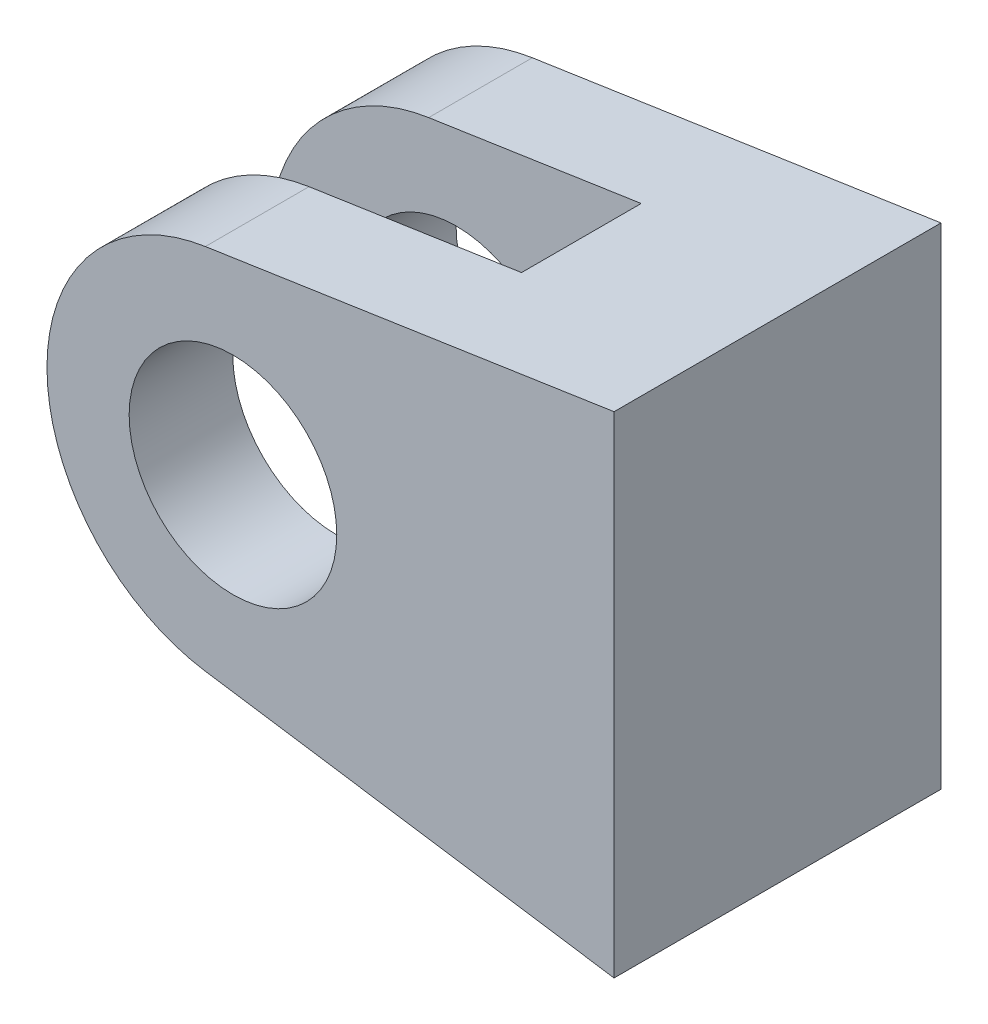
ISO-10303-21;
HEADER;
FILE_DESCRIPTION(('STEP AP214'),'2;1');
FILE_NAME('part.step','',(''),(''),'','','');
FILE_SCHEMA(('AUTOMOTIVE_DESIGN { 1 0 10303 214 1 1 1 1 }'));
ENDSEC;
DATA;
#1=APPLICATION_CONTEXT('core data for automotive mechanical design processes');
#2=APPLICATION_PROTOCOL_DEFINITION('international standard','automotive_design',2000,#1);
#3=PRODUCT_CONTEXT('',#1,'mechanical');
#4=PRODUCT('Part','Part','',(#3));
#5=PRODUCT_RELATED_PRODUCT_CATEGORY('part','',(#4));
#6=PRODUCT_DEFINITION_FORMATION('','',#4);
#7=PRODUCT_DEFINITION_CONTEXT('part definition',#1,'design');
#8=PRODUCT_DEFINITION('design','',#6,#7);
#9=PRODUCT_DEFINITION_SHAPE('','',#8);
#10=(LENGTH_UNIT() NAMED_UNIT(*) SI_UNIT(.MILLI.,.METRE.));
#11=(NAMED_UNIT(*) PLANE_ANGLE_UNIT() SI_UNIT($,.RADIAN.));
#12=(NAMED_UNIT(*) SI_UNIT($,.STERADIAN.) SOLID_ANGLE_UNIT());
#13=UNCERTAINTY_MEASURE_WITH_UNIT(LENGTH_MEASURE(1.E-05),#10,'distance_accuracy_value','');
#14=(GEOMETRIC_REPRESENTATION_CONTEXT(3) GLOBAL_UNCERTAINTY_ASSIGNED_CONTEXT((#13)) GLOBAL_UNIT_ASSIGNED_CONTEXT((#10,
#11,#12)) REPRESENTATION_CONTEXT('',''));
#15=CARTESIAN_POINT('',(0.,0.,0.));
#16=DIRECTION('',(0.,0.,1.));
#17=DIRECTION('',(1.,0.,0.));
#18=AXIS2_PLACEMENT_3D('',#15,#16,#17);
#19=CARTESIAN_POINT('',(70.917585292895,-7.78385160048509,20.));
#20=DIRECTION('',(0.,0.,-1.));
#21=DIRECTION('',(-1.,0.,0.));
#22=AXIS2_PLACEMENT_3D('',#19,#20,#21);
#23=CYLINDRICAL_SURFACE('',#22,11.3758584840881);
#24=DIRECTION('',(0.,0.,-1.));
#25=VECTOR('',#24,1.);
#26=CARTESIAN_POINT('',(69.230085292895,3.46614839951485,20.));
#27=LINE('',#26,#25);
#28=CARTESIAN_POINT('',(69.230085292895,3.46614839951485,20.));
#29=VERTEX_POINT('',#28);
#30=CARTESIAN_POINT('',(69.230085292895,3.46614839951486,13.66));
#31=VERTEX_POINT('',#30);
#32=EDGE_CURVE('E40',#29,#31,#27,.T.);
#33=ORIENTED_EDGE('',*,*,#32,.T.);
#34=CARTESIAN_POINT('',(70.917585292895,-7.78385160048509,13.66));
#35=DIRECTION('',(0.,0.,1.));
#36=DIRECTION('',(1.,0.,0.));
#37=AXIS2_PLACEMENT_3D('',#34,#35,#36);
#38=CIRCLE('',#37,11.3758584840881);
#39=CARTESIAN_POINT('',(69.230085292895,-19.033851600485,13.66));
#40=VERTEX_POINT('',#39);
#41=EDGE_CURVE('E130',#31,#40,#38,.T.);
#42=ORIENTED_EDGE('',*,*,#41,.T.);
#43=DIRECTION('',(0.,0.,-1.));
#44=VECTOR('',#43,1.);
#45=CARTESIAN_POINT('',(69.230085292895,-19.033851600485,20.));
#46=LINE('',#45,#44);
#47=CARTESIAN_POINT('',(69.230085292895,-19.033851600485,20.));
#48=VERTEX_POINT('',#47);
#49=EDGE_CURVE('E127',#48,#40,#46,.T.);
#50=ORIENTED_EDGE('',*,*,#49,.F.);
#51=CARTESIAN_POINT('',(70.917585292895,-7.78385160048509,20.));
#52=DIRECTION('',(0.,0.,1.));
#53=DIRECTION('',(1.,0.,0.));
#54=AXIS2_PLACEMENT_3D('',#51,#52,#53);
#55=CIRCLE('',#54,11.3758584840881);
#56=EDGE_CURVE('E85',#29,#48,#55,.T.);
#57=ORIENTED_EDGE('',*,*,#56,.F.);
#58=EDGE_LOOP('',(#33,#42,#50,#57));
#59=FACE_BOUND('',#58,.T.);
#60=ADVANCED_FACE('F32',(#59),#23,.T.);
#61=CARTESIAN_POINT('',(70.917585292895,-7.78385160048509,20.));
#62=DIRECTION('',(0.,0.,-1.));
#63=DIRECTION('',(-1.,0.,0.));
#64=AXIS2_PLACEMENT_3D('',#61,#62,#63);
#65=CYLINDRICAL_SURFACE('',#64,6.35);
#66=CARTESIAN_POINT('',(70.917585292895,-7.78385160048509,13.66));
#67=DIRECTION('',(0.,0.,1.));
#68=DIRECTION('',(1.,0.,0.));
#69=AXIS2_PLACEMENT_3D('',#66,#67,#68);
#70=CIRCLE('',#69,6.35);
#71=CARTESIAN_POINT('',(77.267585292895,-7.78385160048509,13.66));
#72=VERTEX_POINT('',#71);
#73=EDGE_CURVE('E131',#72,#72,#70,.T.);
#74=ORIENTED_EDGE('',*,*,#73,.F.);
#75=EDGE_LOOP('',(#74));
#76=FACE_BOUND('',#75,.T.);
#77=CARTESIAN_POINT('',(70.917585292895,-7.78385160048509,20.));
#78=DIRECTION('',(0.,0.,1.));
#79=DIRECTION('',(1.,0.,0.));
#80=AXIS2_PLACEMENT_3D('',#77,#78,#79);
#81=CIRCLE('',#80,6.35);
#82=CARTESIAN_POINT('',(77.267585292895,-7.78385160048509,20.));
#83=VERTEX_POINT('',#82);
#84=EDGE_CURVE('E144',#83,#83,#81,.T.);
#85=ORIENTED_EDGE('',*,*,#84,.T.);
#86=EDGE_LOOP('',(#85));
#87=FACE_BOUND('',#86,.T.);
#88=ADVANCED_FACE('F204',(#76,#87),#65,.F.);
#89=CARTESIAN_POINT('',(70.917585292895,-7.78385160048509,20.));
#90=DIRECTION('',(0.,0.,1.));
#91=DIRECTION('',(1.,0.,0.));
#92=AXIS2_PLACEMENT_3D('',#89,#90,#91);
#93=PLANE('',#92);
#94=DIRECTION('',(-0.988936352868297,-0.148340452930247,0.));
#95=VECTOR('',#94,1.);
#96=CARTESIAN_POINT('',(94.230085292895,7.21614839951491,20.));
#97=LINE('',#96,#95);
#98=CARTESIAN_POINT('',(94.230085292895,7.21614839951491,20.));
#99=VERTEX_POINT('',#98);
#100=EDGE_CURVE('E150',#99,#29,#97,.T.);
#101=ORIENTED_EDGE('',*,*,#100,.T.);
#102=ORIENTED_EDGE('',*,*,#56,.T.);
#103=DIRECTION('',(0.988936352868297,-0.148340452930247,0.));
#104=VECTOR('',#103,1.);
#105=CARTESIAN_POINT('',(94.230085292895,-22.7838516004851,20.));
#106=LINE('',#105,#104);
#107=CARTESIAN_POINT('',(94.230085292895,-22.7838516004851,20.));
#108=VERTEX_POINT('',#107);
#109=EDGE_CURVE('E153',#48,#108,#106,.T.);
#110=ORIENTED_EDGE('',*,*,#109,.T.);
#111=DIRECTION('',(0.,1.,0.));
#112=VECTOR('',#111,1.);
#113=CARTESIAN_POINT('',(94.230085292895,7.21614839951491,20.));
#114=LINE('',#113,#112);
#115=EDGE_CURVE('E56',#108,#99,#114,.T.);
#116=ORIENTED_EDGE('',*,*,#115,.T.);
#117=EDGE_LOOP('',(#101,#102,#110,#116));
#118=FACE_BOUND('',#117,.T.);
#119=ORIENTED_EDGE('',*,*,#84,.F.);
#120=EDGE_LOOP('',(#119));
#121=FACE_BOUND('',#120,.T.);
#122=ADVANCED_FACE('F190',(#118,#121),#93,.T.);
#123=CARTESIAN_POINT('',(70.917585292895,-7.78385160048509,0.));
#124=DIRECTION('',(0.,0.,1.));
#125=DIRECTION('',(1.,0.,0.));
#126=AXIS2_PLACEMENT_3D('',#123,#124,#125);
#127=PLANE('',#126);
#128=DIRECTION('',(-0.988936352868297,-0.148340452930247,0.));
#129=VECTOR('',#128,1.);
#130=CARTESIAN_POINT('',(94.230085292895,7.21614839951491,0.));
#131=LINE('',#130,#129);
#132=CARTESIAN_POINT('',(94.230085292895,7.21614839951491,0.));
#133=VERTEX_POINT('',#132);
#134=CARTESIAN_POINT('',(69.230085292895,3.46614839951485,0.));
#135=VERTEX_POINT('',#134);
#136=EDGE_CURVE('E147',#133,#135,#131,.T.);
#137=ORIENTED_EDGE('',*,*,#136,.F.);
#138=DIRECTION('',(0.,1.,0.));
#139=VECTOR('',#138,1.);
#140=CARTESIAN_POINT('',(94.230085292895,7.21614839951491,0.));
#141=LINE('',#140,#139);
#142=CARTESIAN_POINT('',(94.230085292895,-22.7838516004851,0.));
#143=VERTEX_POINT('',#142);
#144=EDGE_CURVE('E77',#143,#133,#141,.T.);
#145=ORIENTED_EDGE('',*,*,#144,.F.);
#146=DIRECTION('',(0.988936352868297,-0.148340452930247,0.));
#147=VECTOR('',#146,1.);
#148=CARTESIAN_POINT('',(94.230085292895,-22.7838516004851,0.));
#149=LINE('',#148,#147);
#150=CARTESIAN_POINT('',(69.230085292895,-19.033851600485,0.));
#151=VERTEX_POINT('',#150);
#152=EDGE_CURVE('E162',#151,#143,#149,.T.);
#153=ORIENTED_EDGE('',*,*,#152,.F.);
#154=CARTESIAN_POINT('',(70.917585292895,-7.78385160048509,0.));
#155=DIRECTION('',(0.,0.,1.));
#156=DIRECTION('',(1.,0.,0.));
#157=AXIS2_PLACEMENT_3D('',#154,#155,#156);
#158=CIRCLE('',#157,11.3758584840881);
#159=EDGE_CURVE('E159',#135,#151,#158,.T.);
#160=ORIENTED_EDGE('',*,*,#159,.F.);
#161=EDGE_LOOP('',(#137,#145,#153,#160));
#162=FACE_BOUND('',#161,.T.);
#163=CARTESIAN_POINT('',(70.917585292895,-7.78385160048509,0.));
#164=DIRECTION('',(0.,0.,1.));
#165=DIRECTION('',(1.,0.,0.));
#166=AXIS2_PLACEMENT_3D('',#163,#164,#165);
#167=CIRCLE('',#166,6.35);
#168=CARTESIAN_POINT('',(77.267585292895,-7.78385160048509,0.));
#169=VERTEX_POINT('',#168);
#170=EDGE_CURVE('E143',#169,#169,#167,.T.);
#171=ORIENTED_EDGE('',*,*,#170,.T.);
#172=EDGE_LOOP('',(#171));
#173=FACE_BOUND('',#172,.T.);
#174=ADVANCED_FACE('F184',(#162,#173),#127,.F.);
#175=CARTESIAN_POINT('',(94.230085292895,7.21614839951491,20.));
#176=DIRECTION('',(0.148340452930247,-0.988936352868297,0.));
#177=DIRECTION('',(0.988936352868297,0.148340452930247,0.));
#178=AXIS2_PLACEMENT_3D('',#175,#176,#177);
#179=PLANE('',#178);
#180=DIRECTION('',(0.,0.,1.));
#181=VECTOR('',#180,1.);
#182=CARTESIAN_POINT('',(82.230085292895,5.41614839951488,20.));
#183=LINE('',#182,#181);
#184=CARTESIAN_POINT('',(82.230085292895,5.41614839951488,6.34));
#185=VERTEX_POINT('',#184);
#186=CARTESIAN_POINT('',(82.230085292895,5.41614839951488,13.66));
#187=VERTEX_POINT('',#186);
#188=EDGE_CURVE('E119',#185,#187,#183,.T.);
#189=ORIENTED_EDGE('',*,*,#188,.T.);
#190=DIRECTION('',(-0.988936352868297,-0.148340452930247,0.));
#191=VECTOR('',#190,1.);
#192=CARTESIAN_POINT('',(94.230085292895,7.21614839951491,13.66));
#193=LINE('',#192,#191);
#194=EDGE_CURVE('E133',#187,#31,#193,.T.);
#195=ORIENTED_EDGE('',*,*,#194,.T.);
#196=ORIENTED_EDGE('',*,*,#32,.F.);
#197=ORIENTED_EDGE('',*,*,#100,.F.);
#198=DIRECTION('',(0.,0.,-1.));
#199=VECTOR('',#198,1.);
#200=CARTESIAN_POINT('',(94.230085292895,7.21614839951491,20.));
#201=LINE('',#200,#199);
#202=EDGE_CURVE('E156',#99,#133,#201,.T.);
#203=ORIENTED_EDGE('',*,*,#202,.T.);
#204=ORIENTED_EDGE('',*,*,#136,.T.);
#205=CARTESIAN_POINT('',(69.230085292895,3.46614839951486,6.34));
#206=VERTEX_POINT('',#205);
#207=EDGE_CURVE('E170',#206,#135,#27,.T.);
#208=ORIENTED_EDGE('',*,*,#207,.F.);
#209=DIRECTION('',(0.988936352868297,0.148340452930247,0.));
#210=VECTOR('',#209,1.);
#211=CARTESIAN_POINT('',(94.230085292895,7.21614839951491,6.34));
#212=LINE('',#211,#210);
#213=EDGE_CURVE('E136',#206,#185,#212,.T.);
#214=ORIENTED_EDGE('',*,*,#213,.T.);
#215=EDGE_LOOP('',(#189,#195,#196,#197,#203,#204,#208,#214));
#216=FACE_BOUND('',#215,.T.);
#217=ADVANCED_FACE('F34',(#216),#179,.F.);
#218=CARTESIAN_POINT('',(69.230085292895,-19.033851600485,6.34));
#219=VERTEX_POINT('',#218);
#220=EDGE_CURVE('E168',#219,#151,#46,.T.);
#221=ORIENTED_EDGE('',*,*,#220,.F.);
#222=CARTESIAN_POINT('',(70.917585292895,-7.78385160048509,6.34));
#223=DIRECTION('',(0.,0.,-1.));
#224=DIRECTION('',(-1.,0.,0.));
#225=AXIS2_PLACEMENT_3D('',#222,#223,#224);
#226=CIRCLE('',#225,11.3758584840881);
#227=EDGE_CURVE('E47',#219,#206,#226,.T.);
#228=ORIENTED_EDGE('',*,*,#227,.T.);
#229=ORIENTED_EDGE('',*,*,#207,.T.);
#230=ORIENTED_EDGE('',*,*,#159,.T.);
#231=EDGE_LOOP('',(#221,#228,#229,#230));
#232=FACE_BOUND('',#231,.T.);
#233=ADVANCED_FACE('F181',(#232),#23,.T.);
#234=CARTESIAN_POINT('',(94.230085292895,-22.7838516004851,20.));
#235=DIRECTION('',(0.148340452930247,0.988936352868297,0.));
#236=DIRECTION('',(-0.988936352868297,0.148340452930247,0.));
#237=AXIS2_PLACEMENT_3D('',#234,#235,#236);
#238=PLANE('',#237);
#239=ORIENTED_EDGE('',*,*,#49,.T.);
#240=DIRECTION('',(0.988936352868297,-0.148340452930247,0.));
#241=VECTOR('',#240,1.);
#242=CARTESIAN_POINT('',(94.230085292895,-22.7838516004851,13.66));
#243=LINE('',#242,#241);
#244=CARTESIAN_POINT('',(82.230085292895,-20.9838516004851,13.66));
#245=VERTEX_POINT('',#244);
#246=EDGE_CURVE('E125',#40,#245,#243,.T.);
#247=ORIENTED_EDGE('',*,*,#246,.T.);
#248=DIRECTION('',(0.,0.,-1.));
#249=VECTOR('',#248,1.);
#250=CARTESIAN_POINT('',(82.230085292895,-20.9838516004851,20.));
#251=LINE('',#250,#249);
#252=CARTESIAN_POINT('',(82.230085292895,-20.9838516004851,6.34));
#253=VERTEX_POINT('',#252);
#254=EDGE_CURVE('E11',#245,#253,#251,.T.);
#255=ORIENTED_EDGE('',*,*,#254,.T.);
#256=DIRECTION('',(-0.988936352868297,0.148340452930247,0.));
#257=VECTOR('',#256,1.);
#258=CARTESIAN_POINT('',(94.230085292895,-22.7838516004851,6.34));
#259=LINE('',#258,#257);
#260=EDGE_CURVE('E105',#253,#219,#259,.T.);
#261=ORIENTED_EDGE('',*,*,#260,.T.);
#262=ORIENTED_EDGE('',*,*,#220,.T.);
#263=ORIENTED_EDGE('',*,*,#152,.T.);
#264=DIRECTION('',(0.,0.,-1.));
#265=VECTOR('',#264,1.);
#266=CARTESIAN_POINT('',(94.230085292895,-22.7838516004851,20.));
#267=LINE('',#266,#265);
#268=EDGE_CURVE('E166',#108,#143,#267,.T.);
#269=ORIENTED_EDGE('',*,*,#268,.F.);
#270=ORIENTED_EDGE('',*,*,#109,.F.);
#271=EDGE_LOOP('',(#239,#247,#255,#261,#262,#263,#269,#270));
#272=FACE_BOUND('',#271,.T.);
#273=ADVANCED_FACE('F124',(#272),#238,.F.);
#274=CARTESIAN_POINT('',(94.230085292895,7.21614839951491,20.));
#275=DIRECTION('',(-1.,0.,0.));
#276=DIRECTION('',(0.,0.,1.));
#277=AXIS2_PLACEMENT_3D('',#274,#275,#276);
#278=PLANE('',#277);
#279=ORIENTED_EDGE('',*,*,#144,.T.);
#280=ORIENTED_EDGE('',*,*,#202,.F.);
#281=ORIENTED_EDGE('',*,*,#115,.F.);
#282=ORIENTED_EDGE('',*,*,#268,.T.);
#283=EDGE_LOOP('',(#279,#280,#281,#282));
#284=FACE_BOUND('',#283,.T.);
#285=ADVANCED_FACE('F187',(#284),#278,.F.);
#286=CARTESIAN_POINT('',(70.917585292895,-7.78385160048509,6.34));
#287=DIRECTION('',(0.,0.,-1.));
#288=DIRECTION('',(-1.,0.,0.));
#289=AXIS2_PLACEMENT_3D('',#286,#287,#288);
#290=CIRCLE('',#289,6.35);
#291=CARTESIAN_POINT('',(64.567585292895,-7.78385160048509,6.34));
#292=VERTEX_POINT('',#291);
#293=EDGE_CURVE('E112',#292,#292,#290,.T.);
#294=ORIENTED_EDGE('',*,*,#293,.F.);
#295=EDGE_LOOP('',(#294));
#296=FACE_BOUND('',#295,.T.);
#297=ORIENTED_EDGE('',*,*,#170,.F.);
#298=EDGE_LOOP('',(#297));
#299=FACE_BOUND('',#298,.T.);
#300=ADVANCED_FACE('F201',(#296,#299),#65,.F.);
#301=CARTESIAN_POINT('',(82.230085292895,-22.7838516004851,6.34));
#302=DIRECTION('',(1.,0.,0.));
#303=DIRECTION('',(0.,0.,-1.));
#304=AXIS2_PLACEMENT_3D('',#301,#302,#303);
#305=PLANE('',#304);
#306=DIRECTION('',(0.,1.,0.));
#307=VECTOR('',#306,1.);
#308=CARTESIAN_POINT('',(82.230085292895,-22.7838516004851,6.34));
#309=LINE('',#308,#307);
#310=EDGE_CURVE('E108',#253,#185,#309,.T.);
#311=ORIENTED_EDGE('',*,*,#310,.F.);
#312=ORIENTED_EDGE('',*,*,#254,.F.);
#313=DIRECTION('',(0.,1.,0.));
#314=VECTOR('',#313,1.);
#315=CARTESIAN_POINT('',(82.230085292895,-22.7838516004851,13.66));
#316=LINE('',#315,#314);
#317=EDGE_CURVE('E120',#245,#187,#316,.T.);
#318=ORIENTED_EDGE('',*,*,#317,.T.);
#319=ORIENTED_EDGE('',*,*,#188,.F.);
#320=EDGE_LOOP('',(#311,#312,#318,#319));
#321=FACE_BOUND('',#320,.T.);
#322=ADVANCED_FACE('F115',(#321),#305,.F.);
#323=CARTESIAN_POINT('',(82.230085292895,-22.7838516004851,13.66));
#324=DIRECTION('',(0.,0.,1.));
#325=DIRECTION('',(1.,0.,0.));
#326=AXIS2_PLACEMENT_3D('',#323,#324,#325);
#327=PLANE('',#326);
#328=ORIENTED_EDGE('',*,*,#73,.T.);
#329=EDGE_LOOP('',(#328));
#330=FACE_BOUND('',#329,.T.);
#331=ORIENTED_EDGE('',*,*,#317,.F.);
#332=ORIENTED_EDGE('',*,*,#246,.F.);
#333=ORIENTED_EDGE('',*,*,#41,.F.);
#334=ORIENTED_EDGE('',*,*,#194,.F.);
#335=EDGE_LOOP('',(#331,#332,#333,#334));
#336=FACE_BOUND('',#335,.T.);
#337=ADVANCED_FACE('F192',(#330,#336),#327,.F.);
#338=CARTESIAN_POINT('',(82.230085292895,-22.7838516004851,6.34));
#339=DIRECTION('',(0.,0.,-1.));
#340=DIRECTION('',(-1.,0.,0.));
#341=AXIS2_PLACEMENT_3D('',#338,#339,#340);
#342=PLANE('',#341);
#343=ORIENTED_EDGE('',*,*,#293,.T.);
#344=EDGE_LOOP('',(#343));
#345=FACE_BOUND('',#344,.T.);
#346=ORIENTED_EDGE('',*,*,#227,.F.);
#347=ORIENTED_EDGE('',*,*,#260,.F.);
#348=ORIENTED_EDGE('',*,*,#310,.T.);
#349=ORIENTED_EDGE('',*,*,#213,.F.);
#350=EDGE_LOOP('',(#346,#347,#348,#349));
#351=FACE_BOUND('',#350,.T.);
#352=ADVANCED_FACE('F107',(#345,#351),#342,.F.);
#353=CLOSED_SHELL('',(#60,#88,#122,#174,#217,#233,#273,#285,#300,#322,#337,#352));
#354=MANIFOLD_SOLID_BREP('B2',#353);
#355=ADVANCED_BREP_SHAPE_REPRESENTATION('',(#18,#354),#14);
#356=SHAPE_DEFINITION_REPRESENTATION(#9,#355);
ENDSEC;
END-ISO-10303-21;
